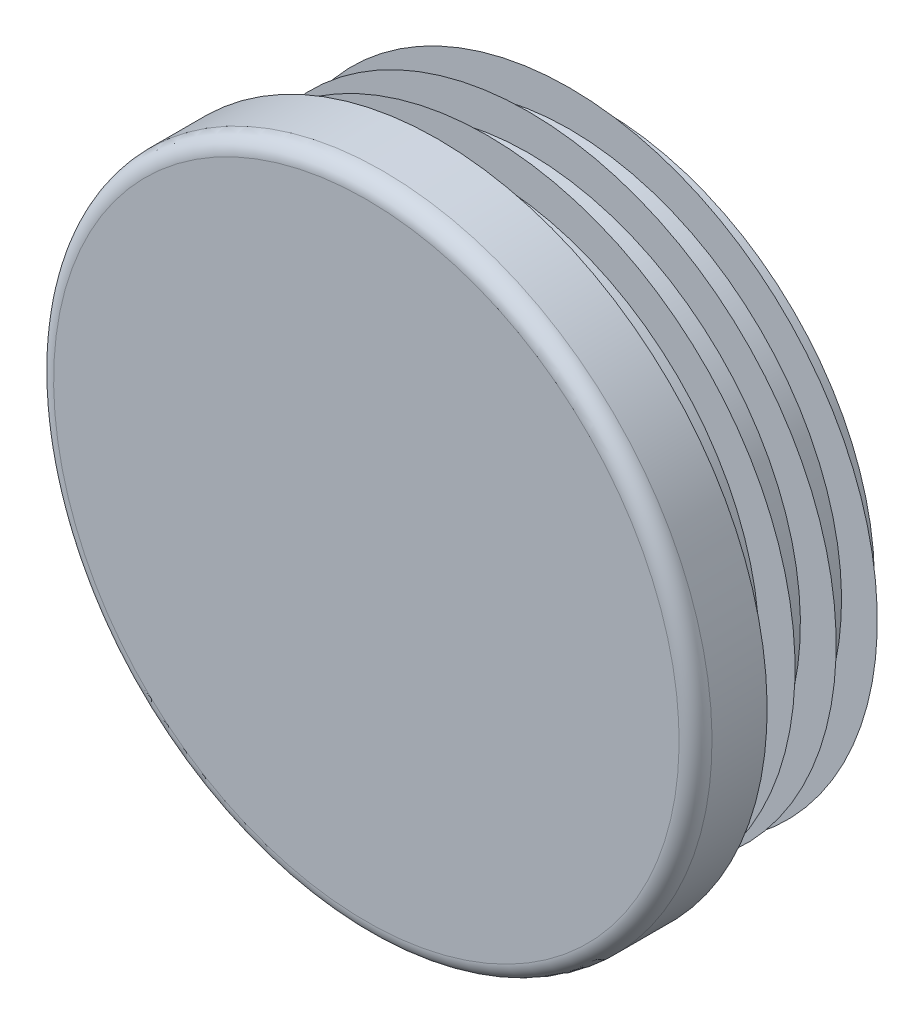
ISO-10303-21;
HEADER;
FILE_DESCRIPTION(('STEP AP214'),'2;1');
FILE_NAME('part.step','',(''),(''),'','','');
FILE_SCHEMA(('AUTOMOTIVE_DESIGN { 1 0 10303 214 1 1 1 1 }'));
ENDSEC;
DATA;
#1=APPLICATION_CONTEXT('core data for automotive mechanical design processes');
#2=APPLICATION_PROTOCOL_DEFINITION('international standard','automotive_design',2000,#1);
#3=PRODUCT_CONTEXT('',#1,'mechanical');
#4=PRODUCT('Part','Part','',(#3));
#5=PRODUCT_RELATED_PRODUCT_CATEGORY('part','',(#4));
#6=PRODUCT_DEFINITION_FORMATION('','',#4);
#7=PRODUCT_DEFINITION_CONTEXT('part definition',#1,'design');
#8=PRODUCT_DEFINITION('design','',#6,#7);
#9=PRODUCT_DEFINITION_SHAPE('','',#8);
#10=(LENGTH_UNIT() NAMED_UNIT(*) SI_UNIT(.MILLI.,.METRE.));
#11=(NAMED_UNIT(*) PLANE_ANGLE_UNIT() SI_UNIT($,.RADIAN.));
#12=(NAMED_UNIT(*) SI_UNIT($,.STERADIAN.) SOLID_ANGLE_UNIT());
#13=UNCERTAINTY_MEASURE_WITH_UNIT(LENGTH_MEASURE(1.E-05),#10,'distance_accuracy_value','');
#14=(GEOMETRIC_REPRESENTATION_CONTEXT(3) GLOBAL_UNCERTAINTY_ASSIGNED_CONTEXT((#13)) GLOBAL_UNIT_ASSIGNED_CONTEXT((#10,
#11,#12)) REPRESENTATION_CONTEXT('',''));
#15=CARTESIAN_POINT('',(0.,0.,0.));
#16=DIRECTION('',(0.,0.,1.));
#17=DIRECTION('',(1.,0.,0.));
#18=AXIS2_PLACEMENT_3D('',#15,#16,#17);
#19=CARTESIAN_POINT('',(0.,0.,5.));
#20=DIRECTION('',(0.,0.,-1.));
#21=DIRECTION('',(0.,1.,0.));
#22=AXIS2_PLACEMENT_3D('',#19,#20,#21);
#23=PLANE('',#22);
#24=CARTESIAN_POINT('',(0.,0.,5.));
#25=DIRECTION('',(0.,0.,-1.));
#26=DIRECTION('',(0.,1.,0.));
#27=AXIS2_PLACEMENT_3D('',#24,#25,#26);
#28=CIRCLE('',#27,21.85);
#29=CARTESIAN_POINT('',(0.,21.85,5.));
#30=VERTEX_POINT('',#29);
#31=EDGE_CURVE('E8',#30,#30,#28,.T.);
#32=ORIENTED_EDGE('',*,*,#31,.F.);
#33=EDGE_LOOP('',(#32));
#34=FACE_BOUND('',#33,.T.);
#35=ADVANCED_FACE('F12',(#34),#23,.F.);
#36=CARTESIAN_POINT('',(0.,0.,3.85));
#37=DIRECTION('',(0.,0.,-1.));
#38=DIRECTION('',(0.,1.,0.));
#39=AXIS2_PLACEMENT_3D('',#36,#37,#38);
#40=TOROIDAL_SURFACE('',#39,21.85,1.15);
#41=ORIENTED_EDGE('',*,*,#31,.T.);
#42=EDGE_LOOP('',(#41));
#43=FACE_BOUND('',#42,.T.);
#44=CARTESIAN_POINT('',(0.,0.,3.85));
#45=DIRECTION('',(0.,0.,-1.));
#46=DIRECTION('',(0.,1.,0.));
#47=AXIS2_PLACEMENT_3D('',#44,#45,#46);
#48=CIRCLE('',#47,23.);
#49=CARTESIAN_POINT('',(0.,23.,3.85));
#50=VERTEX_POINT('',#49);
#51=EDGE_CURVE('E18',#50,#50,#48,.T.);
#52=ORIENTED_EDGE('',*,*,#51,.F.);
#53=EDGE_LOOP('',(#52));
#54=FACE_BOUND('',#53,.T.);
#55=ADVANCED_FACE('F159',(#43,#54),#40,.T.);
#56=CARTESIAN_POINT('',(0.,0.,-11.5));
#57=DIRECTION('',(0.,0.,-1.));
#58=DIRECTION('',(0.,1.,0.));
#59=AXIS2_PLACEMENT_3D('',#56,#57,#58);
#60=CYLINDRICAL_SURFACE('',#59,23.);
#61=CARTESIAN_POINT('',(0.,0.,0.));
#62=DIRECTION('',(0.,0.,-1.));
#63=DIRECTION('',(0.,1.,0.));
#64=AXIS2_PLACEMENT_3D('',#61,#62,#63);
#65=CIRCLE('',#64,23.);
#66=CARTESIAN_POINT('',(0.,23.,0.));
#67=VERTEX_POINT('',#66);
#68=EDGE_CURVE('E22',#67,#67,#65,.T.);
#69=ORIENTED_EDGE('',*,*,#68,.F.);
#70=EDGE_LOOP('',(#69));
#71=FACE_BOUND('',#70,.T.);
#72=ORIENTED_EDGE('',*,*,#51,.T.);
#73=EDGE_LOOP('',(#72));
#74=FACE_BOUND('',#73,.T.);
#75=ADVANCED_FACE('F154',(#71,#74),#60,.T.);
#76=CARTESIAN_POINT('',(23.,0.,0.));
#77=DIRECTION('',(0.,0.,1.));
#78=DIRECTION('',(0.,-1.,0.));
#79=AXIS2_PLACEMENT_3D('',#76,#77,#78);
#80=PLANE('',#79);
#81=CARTESIAN_POINT('',(0.,0.,0.));
#82=DIRECTION('',(0.,0.,-1.));
#83=DIRECTION('',(0.,1.,0.));
#84=AXIS2_PLACEMENT_3D('',#81,#82,#83);
#85=CIRCLE('',#84,19.);
#86=CARTESIAN_POINT('',(0.,19.,0.));
#87=VERTEX_POINT('',#86);
#88=EDGE_CURVE('E26',#87,#87,#85,.T.);
#89=ORIENTED_EDGE('',*,*,#88,.F.);
#90=EDGE_LOOP('',(#89));
#91=FACE_BOUND('',#90,.T.);
#92=ORIENTED_EDGE('',*,*,#68,.T.);
#93=EDGE_LOOP('',(#92));
#94=FACE_BOUND('',#93,.T.);
#95=ADVANCED_FACE('F148',(#91,#94),#80,.F.);
#96=CARTESIAN_POINT('',(0.,0.,-11.5));
#97=DIRECTION('',(0.,0.,-1.));
#98=DIRECTION('',(0.,1.,0.));
#99=AXIS2_PLACEMENT_3D('',#96,#97,#98);
#100=CYLINDRICAL_SURFACE('',#99,19.);
#101=CARTESIAN_POINT('',(0.,0.,-0.575));
#102=DIRECTION('',(0.,0.,-1.));
#103=DIRECTION('',(0.,1.,0.));
#104=AXIS2_PLACEMENT_3D('',#101,#102,#103);
#105=CIRCLE('',#104,19.);
#106=CARTESIAN_POINT('',(0.,19.,-0.575));
#107=VERTEX_POINT('',#106);
#108=EDGE_CURVE('E31',#107,#107,#105,.T.);
#109=ORIENTED_EDGE('',*,*,#108,.F.);
#110=EDGE_LOOP('',(#109));
#111=FACE_BOUND('',#110,.T.);
#112=ORIENTED_EDGE('',*,*,#88,.T.);
#113=EDGE_LOOP('',(#112));
#114=FACE_BOUND('',#113,.T.);
#115=ADVANCED_FACE('F142',(#111,#114),#100,.T.);
#116=CARTESIAN_POINT('',(19.,0.,-0.575));
#117=DIRECTION('',(0.,0.,-1.));
#118=DIRECTION('',(0.,1.,0.));
#119=AXIS2_PLACEMENT_3D('',#116,#117,#118);
#120=PLANE('',#119);
#121=CARTESIAN_POINT('',(0.,0.,-0.575));
#122=DIRECTION('',(0.,0.,-1.));
#123=DIRECTION('',(0.,1.,0.));
#124=AXIS2_PLACEMENT_3D('',#121,#122,#123);
#125=CIRCLE('',#124,21.5);
#126=CARTESIAN_POINT('',(0.,21.5,-0.575));
#127=VERTEX_POINT('',#126);
#128=EDGE_CURVE('E34',#127,#127,#125,.T.);
#129=ORIENTED_EDGE('',*,*,#128,.F.);
#130=EDGE_LOOP('',(#129));
#131=FACE_BOUND('',#130,.T.);
#132=ORIENTED_EDGE('',*,*,#108,.T.);
#133=EDGE_LOOP('',(#132));
#134=FACE_BOUND('',#133,.T.);
#135=ADVANCED_FACE('F136',(#131,#134),#120,.F.);
#136=CARTESIAN_POINT('',(0.,0.,-0.575));
#137=DIRECTION('',(0.,0.,1.));
#138=DIRECTION('',(0.,-1.,0.));
#139=AXIS2_PLACEMENT_3D('',#136,#137,#138);
#140=CONICAL_SURFACE('',#139,21.5,0.959931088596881);
#141=CARTESIAN_POINT('',(0.,0.,-2.32551884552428));
#142=DIRECTION('',(0.,0.,-1.));
#143=DIRECTION('',(0.,1.,0.));
#144=AXIS2_PLACEMENT_3D('',#141,#142,#143);
#145=CIRCLE('',#144,19.);
#146=CARTESIAN_POINT('',(0.,19.,-2.32551884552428));
#147=VERTEX_POINT('',#146);
#148=EDGE_CURVE('E37',#147,#147,#145,.T.);
#149=ORIENTED_EDGE('',*,*,#148,.F.);
#150=EDGE_LOOP('',(#149));
#151=FACE_BOUND('',#150,.T.);
#152=ORIENTED_EDGE('',*,*,#128,.T.);
#153=EDGE_LOOP('',(#152));
#154=FACE_BOUND('',#153,.T.);
#155=ADVANCED_FACE('F130',(#151,#154),#140,.T.);
#156=CARTESIAN_POINT('',(0.,0.,-11.5));
#157=DIRECTION('',(0.,0.,-1.));
#158=DIRECTION('',(0.,1.,0.));
#159=AXIS2_PLACEMENT_3D('',#156,#157,#158);
#160=CYLINDRICAL_SURFACE('',#159,19.);
#161=CARTESIAN_POINT('',(0.,0.,-3.45));
#162=DIRECTION('',(0.,0.,-1.));
#163=DIRECTION('',(0.,1.,0.));
#164=AXIS2_PLACEMENT_3D('',#161,#162,#163);
#165=CIRCLE('',#164,19.);
#166=CARTESIAN_POINT('',(0.,19.,-3.45));
#167=VERTEX_POINT('',#166);
#168=EDGE_CURVE('E40',#167,#167,#165,.T.);
#169=ORIENTED_EDGE('',*,*,#168,.F.);
#170=EDGE_LOOP('',(#169));
#171=FACE_BOUND('',#170,.T.);
#172=ORIENTED_EDGE('',*,*,#148,.T.);
#173=EDGE_LOOP('',(#172));
#174=FACE_BOUND('',#173,.T.);
#175=ADVANCED_FACE('F124',(#171,#174),#160,.T.);
#176=CARTESIAN_POINT('',(19.,0.,-3.45));
#177=DIRECTION('',(0.,0.,-1.));
#178=DIRECTION('',(0.,1.,0.));
#179=AXIS2_PLACEMENT_3D('',#176,#177,#178);
#180=PLANE('',#179);
#181=CARTESIAN_POINT('',(0.,0.,-3.45));
#182=DIRECTION('',(0.,0.,-1.));
#183=DIRECTION('',(0.,1.,0.));
#184=AXIS2_PLACEMENT_3D('',#181,#182,#183);
#185=CIRCLE('',#184,21.5);
#186=CARTESIAN_POINT('',(0.,21.5,-3.45));
#187=VERTEX_POINT('',#186);
#188=EDGE_CURVE('E43',#187,#187,#185,.T.);
#189=ORIENTED_EDGE('',*,*,#188,.F.);
#190=EDGE_LOOP('',(#189));
#191=FACE_BOUND('',#190,.T.);
#192=ORIENTED_EDGE('',*,*,#168,.T.);
#193=EDGE_LOOP('',(#192));
#194=FACE_BOUND('',#193,.T.);
#195=ADVANCED_FACE('F118',(#191,#194),#180,.F.);
#196=CARTESIAN_POINT('',(0.,0.,-3.45));
#197=DIRECTION('',(0.,0.,1.));
#198=DIRECTION('',(0.,-1.,0.));
#199=AXIS2_PLACEMENT_3D('',#196,#197,#198);
#200=CONICAL_SURFACE('',#199,21.5,0.959931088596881);
#201=CARTESIAN_POINT('',(0.,0.,-5.20051884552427));
#202=DIRECTION('',(0.,0.,-1.));
#203=DIRECTION('',(0.,1.,0.));
#204=AXIS2_PLACEMENT_3D('',#201,#202,#203);
#205=CIRCLE('',#204,19.);
#206=CARTESIAN_POINT('',(0.,19.,-5.20051884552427));
#207=VERTEX_POINT('',#206);
#208=EDGE_CURVE('E46',#207,#207,#205,.T.);
#209=ORIENTED_EDGE('',*,*,#208,.F.);
#210=EDGE_LOOP('',(#209));
#211=FACE_BOUND('',#210,.T.);
#212=ORIENTED_EDGE('',*,*,#188,.T.);
#213=EDGE_LOOP('',(#212));
#214=FACE_BOUND('',#213,.T.);
#215=ADVANCED_FACE('F112',(#211,#214),#200,.T.);
#216=CARTESIAN_POINT('',(0.,0.,-11.5));
#217=DIRECTION('',(0.,0.,-1.));
#218=DIRECTION('',(0.,1.,0.));
#219=AXIS2_PLACEMENT_3D('',#216,#217,#218);
#220=CYLINDRICAL_SURFACE('',#219,19.);
#221=CARTESIAN_POINT('',(0.,0.,-6.325));
#222=DIRECTION('',(0.,0.,-1.));
#223=DIRECTION('',(0.,1.,0.));
#224=AXIS2_PLACEMENT_3D('',#221,#222,#223);
#225=CIRCLE('',#224,19.);
#226=CARTESIAN_POINT('',(0.,19.,-6.325));
#227=VERTEX_POINT('',#226);
#228=EDGE_CURVE('E49',#227,#227,#225,.T.);
#229=ORIENTED_EDGE('',*,*,#228,.F.);
#230=EDGE_LOOP('',(#229));
#231=FACE_BOUND('',#230,.T.);
#232=ORIENTED_EDGE('',*,*,#208,.T.);
#233=EDGE_LOOP('',(#232));
#234=FACE_BOUND('',#233,.T.);
#235=ADVANCED_FACE('F106',(#231,#234),#220,.T.);
#236=CARTESIAN_POINT('',(19.,0.,-6.325));
#237=DIRECTION('',(0.,0.,-1.));
#238=DIRECTION('',(0.,1.,0.));
#239=AXIS2_PLACEMENT_3D('',#236,#237,#238);
#240=PLANE('',#239);
#241=CARTESIAN_POINT('',(0.,0.,-6.325));
#242=DIRECTION('',(0.,0.,-1.));
#243=DIRECTION('',(0.,1.,0.));
#244=AXIS2_PLACEMENT_3D('',#241,#242,#243);
#245=CIRCLE('',#244,21.5);
#246=CARTESIAN_POINT('',(0.,21.5,-6.325));
#247=VERTEX_POINT('',#246);
#248=EDGE_CURVE('E52',#247,#247,#245,.T.);
#249=ORIENTED_EDGE('',*,*,#248,.F.);
#250=EDGE_LOOP('',(#249));
#251=FACE_BOUND('',#250,.T.);
#252=ORIENTED_EDGE('',*,*,#228,.T.);
#253=EDGE_LOOP('',(#252));
#254=FACE_BOUND('',#253,.T.);
#255=ADVANCED_FACE('F100',(#251,#254),#240,.F.);
#256=CARTESIAN_POINT('',(0.,0.,-6.325));
#257=DIRECTION('',(0.,0.,1.));
#258=DIRECTION('',(0.,-1.,0.));
#259=AXIS2_PLACEMENT_3D('',#256,#257,#258);
#260=CONICAL_SURFACE('',#259,21.5,0.959931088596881);
#261=CARTESIAN_POINT('',(0.,0.,-8.07551884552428));
#262=DIRECTION('',(0.,0.,-1.));
#263=DIRECTION('',(0.,1.,0.));
#264=AXIS2_PLACEMENT_3D('',#261,#262,#263);
#265=CIRCLE('',#264,19.);
#266=CARTESIAN_POINT('',(0.,19.,-8.07551884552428));
#267=VERTEX_POINT('',#266);
#268=EDGE_CURVE('E55',#267,#267,#265,.T.);
#269=ORIENTED_EDGE('',*,*,#268,.F.);
#270=EDGE_LOOP('',(#269));
#271=FACE_BOUND('',#270,.T.);
#272=ORIENTED_EDGE('',*,*,#248,.T.);
#273=EDGE_LOOP('',(#272));
#274=FACE_BOUND('',#273,.T.);
#275=ADVANCED_FACE('F94',(#271,#274),#260,.T.);
#276=CARTESIAN_POINT('',(0.,0.,-11.5));
#277=DIRECTION('',(0.,0.,-1.));
#278=DIRECTION('',(0.,1.,0.));
#279=AXIS2_PLACEMENT_3D('',#276,#277,#278);
#280=CYLINDRICAL_SURFACE('',#279,19.);
#281=CARTESIAN_POINT('',(0.,0.,-9.2));
#282=DIRECTION('',(0.,0.,-1.));
#283=DIRECTION('',(0.,1.,0.));
#284=AXIS2_PLACEMENT_3D('',#281,#282,#283);
#285=CIRCLE('',#284,19.);
#286=CARTESIAN_POINT('',(0.,19.,-9.2));
#287=VERTEX_POINT('',#286);
#288=EDGE_CURVE('E58',#287,#287,#285,.T.);
#289=ORIENTED_EDGE('',*,*,#288,.F.);
#290=EDGE_LOOP('',(#289));
#291=FACE_BOUND('',#290,.T.);
#292=ORIENTED_EDGE('',*,*,#268,.T.);
#293=EDGE_LOOP('',(#292));
#294=FACE_BOUND('',#293,.T.);
#295=ADVANCED_FACE('F88',(#291,#294),#280,.T.);
#296=CARTESIAN_POINT('',(19.,0.,-9.2));
#297=DIRECTION('',(0.,0.,-1.));
#298=DIRECTION('',(0.,1.,0.));
#299=AXIS2_PLACEMENT_3D('',#296,#297,#298);
#300=PLANE('',#299);
#301=CARTESIAN_POINT('',(0.,0.,-9.2));
#302=DIRECTION('',(0.,0.,-1.));
#303=DIRECTION('',(0.,1.,0.));
#304=AXIS2_PLACEMENT_3D('',#301,#302,#303);
#305=CIRCLE('',#304,21.5);
#306=CARTESIAN_POINT('',(0.,21.5,-9.2));
#307=VERTEX_POINT('',#306);
#308=EDGE_CURVE('E61',#307,#307,#305,.T.);
#309=ORIENTED_EDGE('',*,*,#308,.F.);
#310=EDGE_LOOP('',(#309));
#311=FACE_BOUND('',#310,.T.);
#312=ORIENTED_EDGE('',*,*,#288,.T.);
#313=EDGE_LOOP('',(#312));
#314=FACE_BOUND('',#313,.T.);
#315=ADVANCED_FACE('F82',(#311,#314),#300,.F.);
#316=CARTESIAN_POINT('',(0.,0.,-9.2));
#317=DIRECTION('',(0.,0.,1.));
#318=DIRECTION('',(0.,-1.,0.));
#319=AXIS2_PLACEMENT_3D('',#316,#317,#318);
#320=CONICAL_SURFACE('',#319,21.5,0.959931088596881);
#321=CARTESIAN_POINT('',(0.,0.,-10.9505188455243));
#322=DIRECTION('',(0.,0.,-1.));
#323=DIRECTION('',(0.,1.,0.));
#324=AXIS2_PLACEMENT_3D('',#321,#322,#323);
#325=CIRCLE('',#324,19.);
#326=CARTESIAN_POINT('',(0.,19.,-10.9505188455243));
#327=VERTEX_POINT('',#326);
#328=EDGE_CURVE('E64',#327,#327,#325,.T.);
#329=ORIENTED_EDGE('',*,*,#328,.F.);
#330=EDGE_LOOP('',(#329));
#331=FACE_BOUND('',#330,.T.);
#332=ORIENTED_EDGE('',*,*,#308,.T.);
#333=EDGE_LOOP('',(#332));
#334=FACE_BOUND('',#333,.T.);
#335=ADVANCED_FACE('F76',(#331,#334),#320,.T.);
#336=CARTESIAN_POINT('',(0.,0.,-11.5));
#337=DIRECTION('',(0.,0.,-1.));
#338=DIRECTION('',(0.,1.,0.));
#339=AXIS2_PLACEMENT_3D('',#336,#337,#338);
#340=CYLINDRICAL_SURFACE('',#339,19.);
#341=CARTESIAN_POINT('',(0.,0.,-11.5));
#342=DIRECTION('',(0.,0.,-1.));
#343=DIRECTION('',(0.,1.,0.));
#344=AXIS2_PLACEMENT_3D('',#341,#342,#343);
#345=CIRCLE('',#344,19.);
#346=CARTESIAN_POINT('',(0.,19.,-11.5));
#347=VERTEX_POINT('',#346);
#348=EDGE_CURVE('E67',#347,#347,#345,.T.);
#349=ORIENTED_EDGE('',*,*,#348,.F.);
#350=EDGE_LOOP('',(#349));
#351=FACE_BOUND('',#350,.T.);
#352=ORIENTED_EDGE('',*,*,#328,.T.);
#353=EDGE_LOOP('',(#352));
#354=FACE_BOUND('',#353,.T.);
#355=ADVANCED_FACE('F73',(#351,#354),#340,.T.);
#356=CARTESIAN_POINT('',(19.,0.,-11.5));
#357=DIRECTION('',(0.,0.,1.));
#358=DIRECTION('',(0.,-1.,0.));
#359=AXIS2_PLACEMENT_3D('',#356,#357,#358);
#360=PLANE('',#359);
#361=ORIENTED_EDGE('',*,*,#348,.T.);
#362=EDGE_LOOP('',(#361));
#363=FACE_BOUND('',#362,.T.);
#364=ADVANCED_FACE('F71',(#363),#360,.F.);
#365=CLOSED_SHELL('',(#35,#55,#75,#95,#115,#135,#155,#175,#195,#215,#235,#255,#275,#295,#315,
#335,#355,#364));
#366=MANIFOLD_SOLID_BREP('B1',#365);
#367=ADVANCED_BREP_SHAPE_REPRESENTATION('',(#18,#366),#14);
#368=SHAPE_DEFINITION_REPRESENTATION(#9,#367);
ENDSEC;
END-ISO-10303-21;
